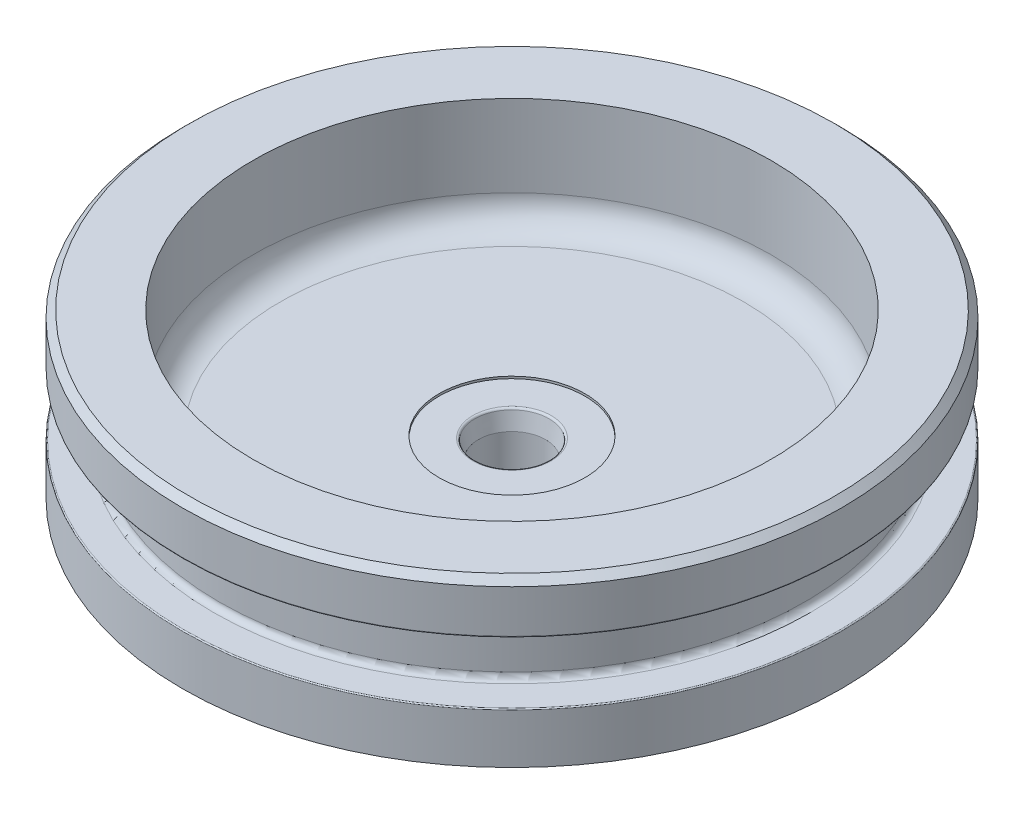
from build123d import *

# Parameters (mm, degrees)
SKETCH2_W           = 38.4175
SKETCH2_H           = 19.05
SKETCH22_R          = 10.668
SKETCH22_R_2        = 7.8994
BOSS_EXTRUDE2_DEPTH = 19.05
CHAMFER1_SIZE       = 1.27
SKETCH31_R          = 30.2006
CUT_EXTRUDE5_DEPTH  = 12.7
FILLET3_R           = 3.175
CHAMFER2_SIZE       = 0.79375
SKETCH39_R          = 7.8994
SKETCH39_R_2        = 3.96875
BOSS_EXTRUDE4_DEPTH = 6.35


with BuildPart() as part:
    # Sketch2 → Revolve1 (revolve)
    with BuildSketch(Plane.XY, mode=Mode.PRIVATE) as revolve1_sk:
        with Locations((-19.20875, -9.525)):
            Rectangle(SKETCH2_W, SKETCH2_H)
    revolve(revolve1_sk.sketch.rotate(Axis((0, 0, 0), (0, 1, 0)), 270), axis=Axis((0, 0, 0), (0, 1, 0)))

    # Port Sketch → SAE Port (revolve, cut)
    with BuildSketch(Plane(origin=(1.57790185, 0, 0.931432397), x_dir=(-0.8611569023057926, 0, -0.5083392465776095), z_dir=(-0.5083392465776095, 0, 0.8611569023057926)), mode=Mode.PRIVATE) as sae_port_sk:
        with BuildLine():
            Line((1.832304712, 40.429612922), (5.286704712, 38.354))
            Line((5.286704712, 38.354), (5.286704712, 10.254))
            Line((5.286704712, 10.254), (5.801054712, 10.254))
            Line((5.801054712, 10.254), (5.801054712, 2.308196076))
            Line((5.801054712, 2.308196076), (5.755250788, 2.354))
            Line((5.755250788, 2.354), (6.158855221, 0.455190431))
            ThreePointArc((6.158855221, 0.455190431), (6.247457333, 0.310604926), (6.407304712, 0.254))
            Line((6.407304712, 0.254), (10.332304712, 0.254))
            Line((10.332304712, 0.254), (10.332304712, 0))
            Line((10.332304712, 0), (1.832304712, 0))
            Line((1.832304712, 0), (1.832304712, 40.429612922))
        make_face()
    revolve(sae_port_sk.sketch.rotate(Axis((0, 0, 0), (0, -1, 0)), 239.446729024), axis=Axis((0, 0, 0), (0, -1, 0)), mode=Mode.SUBTRACT)

    # Sketch22 → Boss-Extrude2 (add)
    with BuildSketch(Plane.XZ.offset(19.05)):
        with Locations(Location((0, 0, 0), (0, 0, 90))):
            Circle(SKETCH22_R)
        with Locations(Location((0, 0, 0), (0, 0, 90))):
            Circle(SKETCH22_R_2, mode=Mode.SUBTRACT)
    extrude(amount=BOSS_EXTRUDE2_DEPTH)

    # Chamfer1
    chamfer1_edges = [part.edges().sort_by_distance(p)[0] for p in [
        (0, -38.1, -10.668),
    ]]
    chamfer(chamfer1_edges, length=CHAMFER1_SIZE)

    # Sketch31 → Cut-Extrude5 (cut)
    with BuildSketch(Plane.XZ):
        with Locations(Location((0, 0, 0), (0, 0, 270))):
            Circle(SKETCH31_R)
    extrude(amount=CUT_EXTRUDE5_DEPTH, mode=Mode.SUBTRACT)

    # Fillet3
    fillet3_edges = [part.edges().sort_by_distance(p)[0] for p in [
        (0, -12.7, 30.2006),
    ]]
    fillet(fillet3_edges, radius=FILLET3_R)

    # Sketch35 → Groove for AS 568-334_ O-Ring1 (revolve, cut)
    with BuildSketch(Plane(origin=(0, 0, 0), x_dir=(0, 0, -1), z_dir=(-1, 0, 0)), mode=Mode.PRIVATE) as groove_for_as_568_334_o_ring1_sk:
        with BuildLine():
            Line((34.8361, 5.92455), (38.2905, 5.92455))
            ThreePointArc((38.2905, 5.92455), (38.380302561, 5.887352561), (38.4175, 5.79755))
            Line((38.4175, 5.79755), (38.4175, 13.25245))
            ThreePointArc((38.4175, 13.25245), (38.380302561, 13.162647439), (38.2905, 13.12545))
            Line((38.2905, 13.12545), (34.8361, 13.12545))
            ThreePointArc((34.8361, 13.12545), (34.342185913, 12.920864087), (34.1376, 12.42695))
            Line((34.1376, 12.42695), (34.1376, 6.62305))
            ThreePointArc((34.1376, 6.62305), (34.342185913, 6.129135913), (34.8361, 5.92455))
        make_face()
    revolve(groove_for_as_568_334_o_ring1_sk.sketch.rotate(Axis((0, -5.79755, 0), (0, 1, 0)), 180), axis=Axis((0, -5.79755, 0), (0, 1, 0)), mode=Mode.SUBTRACT)

    # Chamfer2
    chamfer2_edges = [part.edges().sort_by_distance(p)[0] for p in [
        (0, 0, 38.4175),
    ]]
    chamfer(chamfer2_edges, length=CHAMFER2_SIZE)

    # Sketch37 → Cut-Revolve2 (revolve, cut)
    with BuildSketch(Plane.XY, mode=Mode.PRIVATE) as cut_revolve2_sk:
        with BuildLine():
            Line((3.4544, -51.054), (0, -51.054))
            Line((0, -51.054), (0, -12.7))
            Line((0, -12.7), (8.5, -12.7))
            Line((8.5, -12.7), (8.5, -12.954))
            Line((8.5, -12.954), (4.575, -12.954))
            ThreePointArc((4.575, -12.954), (4.415152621, -13.010604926), (4.326550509, -13.155190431))
            Line((4.326550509, -13.155190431), (3.922946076, -15.054))
            Line((3.922946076, -15.054), (3.96875, -15.008196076))
            Line((3.96875, -15.008196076), (3.96875, -22.954))
            Line((3.96875, -22.954), (3.4544, -22.954))
            Line((3.4544, -22.954), (3.4544, -51.054))
        make_face()
    revolve(cut_revolve2_sk.sketch.rotate(Axis((0, 0, 0), (0, -1, 0)), 90), axis=Axis((0, 0, 0), (0, -1, 0)), mode=Mode.SUBTRACT)

    # Sketch39 → Boss-Extrude4 (add)
    with BuildSketch(Plane.XZ.offset(19.05)):
        with Locations(Location((0, 0, 0), (0, 0, 90))):
            Circle(SKETCH39_R)
        with Locations(Location((0, 0, 0), (0, 0, 90))):
            Circle(SKETCH39_R_2, mode=Mode.SUBTRACT)
    extrude(amount=BOSS_EXTRUDE4_DEPTH)


solid = part.part
